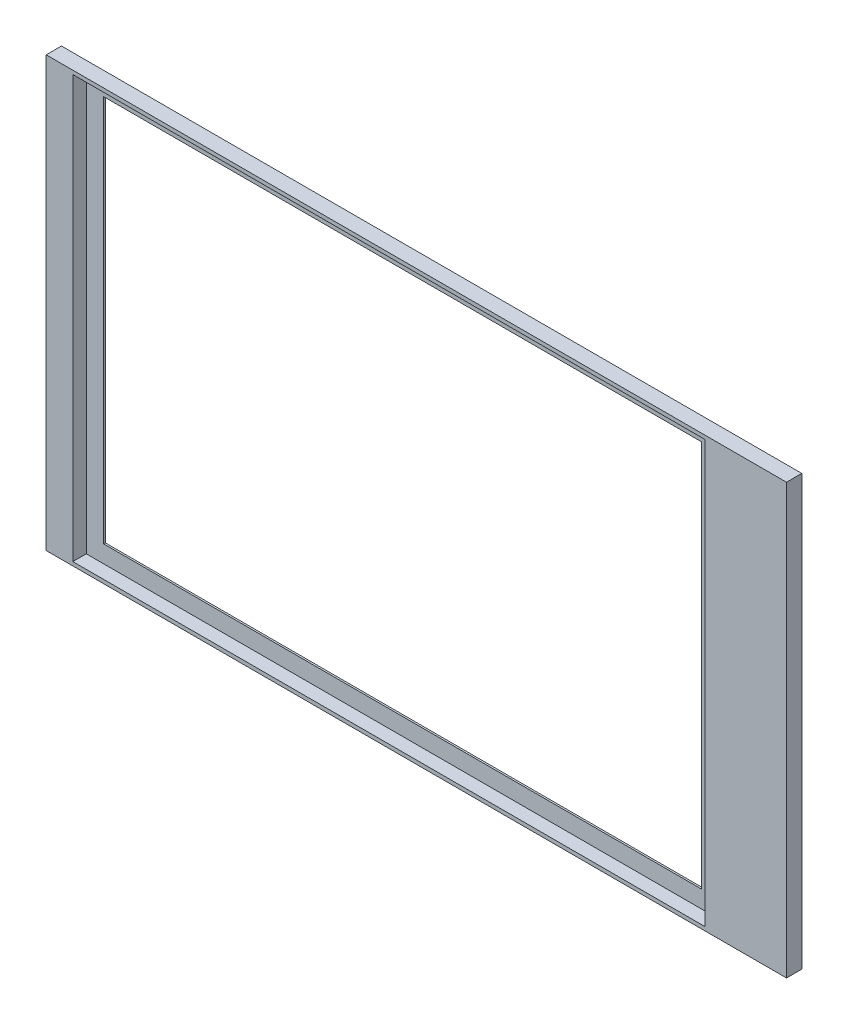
from build123d import *

# Parameters (mm, degrees)
CROQUIS1_W              = 1191.5
CROQUIS1_H              = 723
SALIENTE_EXTRUIR1_DEPTH = 23
CROQUIS2_W              = 1191.5
CROQUIS2_H              = 38
CORTAR_EXTRUIR1_DEPTH   = 20.34
CROQUIS3_W              = 953
CROQUIS3_H              = 635.68
CORTAR_EXTRUIR2_DEPTH   = 20.34
CORTAR_EXTRUIR4_REACH   = 1395.849
CROQUIS5_W              = 901
CROQUIS5_H              = 583.68
CROQUIS6_R              = 4.7625
CORTAR_EXTRUIR5_DEPTH   = 65
CROQUIS7_W              = 23
CROQUIS7_H              = 647
CORTAR_EXTRUIR6_DEPTH   = 38
CORTAR_EXTRUIR7_REACH   = 1395.849
CROQUIS8_W              = 1191.5
CROQUIS8_H              = 38
CROQUIS9_W              = 1191.5
CROQUIS9_H              = 38
CORTAR_EXTRUIR8_DEPTH   = 10
CORTAR_EXTRUIR9_REACH   = 1343.759
CROQUIS10_W             = 6
CROQUIS10_H             = 647
CORTAR_EXTRUIR10_REACH  = 1343.759
CROQUIS11_W             = 32
CROQUIS11_H             = 647


with BuildPart() as part:
    # Croquis1 → Saliente-Extruir1 (new body)
    with BuildSketch(Plane.XY):
        with Locations((595.75, 361.5)):
            Rectangle(CROQUIS1_W, CROQUIS1_H)
    extrude(amount=SALIENTE_EXTRUIR1_DEPTH)

    # Croquis2 → Cortar-Extruir1 (cut)
    with BuildSketch(Plane(origin=(0, 0, 0), x_dir=(-1, 0, 0), z_dir=(0, 0, -1))):
        with Locations((-595.75, 704)):
            Rectangle(CROQUIS2_W, CROQUIS2_H)
        with Locations((-595.75, 19)):
            Rectangle(CROQUIS2_W, CROQUIS2_H)
    extrude(amount=-CORTAR_EXTRUIR1_DEPTH, mode=Mode.SUBTRACT)

    # Croquis3 → Cortar-Extruir2 (cut)
    with BuildSketch(Plane.XY.offset(23)):
        with Locations((554.5, 361.5)):
            Rectangle(CROQUIS3_W, CROQUIS3_H)
    extrude(amount=-CORTAR_EXTRUIR2_DEPTH, mode=Mode.SUBTRACT)

    # Croquis5 → Cortar-Extruir4 (cut, up to next)
    with BuildSketch(Plane.XY.offset(2.66), mode=Mode.PRIVATE) as cortar_extruir4_sk1:
        with Locations((554.5, 361.5)):
            Rectangle(CROQUIS5_W, CROQUIS5_H)
    cortar_extruir4_tool1 = extrude(cortar_extruir4_sk1.sketch, amount=-CORTAR_EXTRUIR4_REACH, mode=Mode.PRIVATE) & part.part
    add(cortar_extruir4_tool1.solids().sort_by_distance((554.5, 361.5, 2.66))[0], mode=Mode.SUBTRACT)

    # Croquis6 → Cortar-Extruir5 (cut)
    with BuildSketch(Plane.ZY):
        with Locations((12.75, 81.25)):
            Circle(CROQUIS6_R)
        with Locations((12.75, 46.25)):
            Circle(CROQUIS6_R)
        with Locations((12.75, 116.25)):
            Circle(CROQUIS6_R)
        with Locations((12.75, 151.25)):
            Circle(CROQUIS6_R)
        with Locations((12.75, 186.25)):
            Circle(CROQUIS6_R)
        with Locations((12.75, 221.25)):
            Circle(CROQUIS6_R)
        with Locations((12.75, 256.25)):
            Circle(CROQUIS6_R)
        with Locations((12.75, 291.25)):
            Circle(CROQUIS6_R)
        with Locations((12.75, 326.25)):
            Circle(CROQUIS6_R)
        with Locations((12.75, 361.25)):
            Circle(CROQUIS6_R)
        with Locations((12.75, 396.25)):
            Circle(CROQUIS6_R)
        with Locations((12.75, 431.25)):
            Circle(CROQUIS6_R)
        with Locations((12.75, 466.25)):
            Circle(CROQUIS6_R)
        with Locations((12.75, 501.25)):
            Circle(CROQUIS6_R)
        with Locations((12.75, 536.25)):
            Circle(CROQUIS6_R)
        with Locations((12.75, 571.25)):
            Circle(CROQUIS6_R)
        with Locations((12.75, 606.25)):
            Circle(CROQUIS6_R)
        with Locations((12.75, 641.25)):
            Circle(CROQUIS6_R)
        with Locations((12.75, 676.25)):
            Circle(CROQUIS6_R)
    extrude(amount=-CORTAR_EXTRUIR5_DEPTH, mode=Mode.SUBTRACT)

    # Croquis7 → Cortar-Extruir6 (cut)
    with BuildSketch(Plane(origin=(1191.5, 0, 0), x_dir=(0, 0, -1), z_dir=(1, 0, 0))):
        with Locations((-11.5, 361.5)):
            Rectangle(CROQUIS7_W, CROQUIS7_H)
    extrude(amount=-CORTAR_EXTRUIR6_DEPTH, mode=Mode.SUBTRACT)

    # Croquis8 → Cortar-Extruir7 (cut, up to next)
    with BuildSketch(Plane(origin=(0, 0, 20.34), x_dir=(-1, 0, 0), z_dir=(0, 0, -1)), mode=Mode.PRIVATE) as cortar_extruir7_sk1:
        with Locations((-595.75, 19)):
            Rectangle(CROQUIS8_W, CROQUIS8_H)
    cortar_extruir7_tool1 = extrude(cortar_extruir7_sk1.sketch, amount=-CORTAR_EXTRUIR7_REACH, mode=Mode.PRIVATE) & part.part
    add(cortar_extruir7_tool1.solids().sort_by_distance((595.75, 19, 20.34))[0], mode=Mode.SUBTRACT)

    # Croquis9 → Cortar-Extruir8 (cut)
    with BuildSketch(Plane(origin=(0, 0, 20.34), x_dir=(-1, 0, 0), z_dir=(0, 0, -1))):
        with Locations((-595.75, 704)):
            Rectangle(CROQUIS9_W, CROQUIS9_H)
    extrude(amount=-CORTAR_EXTRUIR8_DEPTH, mode=Mode.SUBTRACT)

    # Croquis10 → Cortar-Extruir9 (cut, up to next)
    with BuildSketch(Plane.XY.offset(23), mode=Mode.PRIVATE) as cortar_extruir9_sk1:
        with Locations((3, 361.5)):
            Rectangle(CROQUIS10_W, CROQUIS10_H)
    cortar_extruir9_tool1 = extrude(cortar_extruir9_sk1.sketch, amount=-CORTAR_EXTRUIR9_REACH, mode=Mode.PRIVATE) & part.part
    add(cortar_extruir9_tool1.solids().sort_by_distance((3, 361.5, 23))[0], mode=Mode.SUBTRACT)

    # Croquis11 → Cortar-Extruir10 (cut, up to next)
    with BuildSketch(Plane.XY.offset(23), mode=Mode.PRIVATE) as cortar_extruir10_sk1:
        with Locations((22, 361.5)):
            Rectangle(CROQUIS11_W, CROQUIS11_H)
    cortar_extruir10_tool1 = extrude(cortar_extruir10_sk1.sketch, amount=-CORTAR_EXTRUIR10_REACH, mode=Mode.PRIVATE) & part.part
    add(cortar_extruir10_tool1.solids().sort_by_distance((22, 361.5, 23))[0], mode=Mode.SUBTRACT)


solid = part.part
